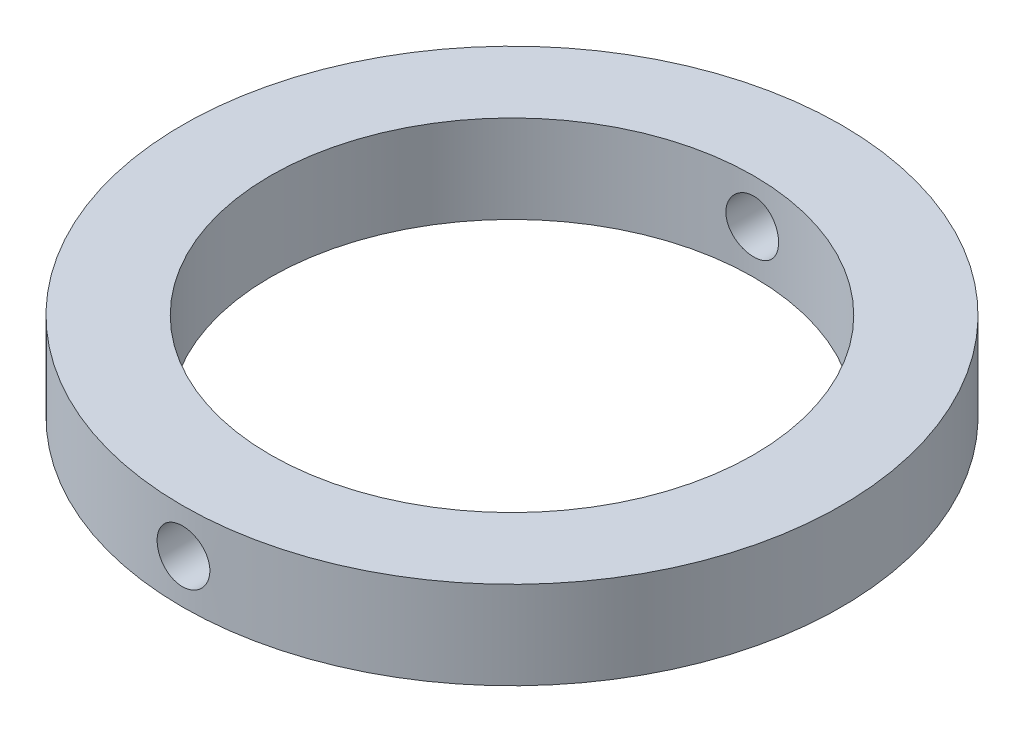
ISO-10303-21;
HEADER;
FILE_DESCRIPTION(('STEP AP214'),'2;1');
FILE_NAME('part.step','',(''),(''),'','','');
FILE_SCHEMA(('AUTOMOTIVE_DESIGN { 1 0 10303 214 1 1 1 1 }'));
ENDSEC;
DATA;
#1=APPLICATION_CONTEXT('core data for automotive mechanical design processes');
#2=APPLICATION_PROTOCOL_DEFINITION('international standard','automotive_design',2000,#1);
#3=PRODUCT_CONTEXT('',#1,'mechanical');
#4=PRODUCT('Part','Part','',(#3));
#5=PRODUCT_RELATED_PRODUCT_CATEGORY('part','',(#4));
#6=PRODUCT_DEFINITION_FORMATION('','',#4);
#7=PRODUCT_DEFINITION_CONTEXT('part definition',#1,'design');
#8=PRODUCT_DEFINITION('design','',#6,#7);
#9=PRODUCT_DEFINITION_SHAPE('','',#8);
#10=(LENGTH_UNIT() NAMED_UNIT(*) SI_UNIT(.MILLI.,.METRE.));
#11=(NAMED_UNIT(*) PLANE_ANGLE_UNIT() SI_UNIT($,.RADIAN.));
#12=(NAMED_UNIT(*) SI_UNIT($,.STERADIAN.) SOLID_ANGLE_UNIT());
#13=UNCERTAINTY_MEASURE_WITH_UNIT(LENGTH_MEASURE(1.E-05),#10,'distance_accuracy_value','');
#14=(GEOMETRIC_REPRESENTATION_CONTEXT(3) GLOBAL_UNCERTAINTY_ASSIGNED_CONTEXT((#13)) GLOBAL_UNIT_ASSIGNED_CONTEXT((#10,
#11,#12)) REPRESENTATION_CONTEXT('',''));
#15=CARTESIAN_POINT('',(0.,0.,0.));
#16=DIRECTION('',(0.,0.,1.));
#17=DIRECTION('',(1.,0.,0.));
#18=AXIS2_PLACEMENT_3D('',#15,#16,#17);
#19=CARTESIAN_POINT('',(0.,10.,0.));
#20=DIRECTION('',(0.,1.,0.));
#21=DIRECTION('',(0.,0.,1.));
#22=AXIS2_PLACEMENT_3D('',#19,#20,#21);
#23=PLANE('',#22);
#24=CARTESIAN_POINT('',(0.,10.,0.));
#25=DIRECTION('',(0.,1.,0.));
#26=DIRECTION('',(0.,0.,1.));
#27=AXIS2_PLACEMENT_3D('',#24,#25,#26);
#28=CIRCLE('',#27,37.5);
#29=CARTESIAN_POINT('',(0.,10.,37.5));
#30=VERTEX_POINT('',#29);
#31=EDGE_CURVE('E10',#30,#30,#28,.T.);
#32=ORIENTED_EDGE('',*,*,#31,.T.);
#33=EDGE_LOOP('',(#32));
#34=FACE_BOUND('',#33,.T.);
#35=CARTESIAN_POINT('',(0.,10.,0.));
#36=DIRECTION('',(0.,1.,0.));
#37=DIRECTION('',(0.,0.,1.));
#38=AXIS2_PLACEMENT_3D('',#35,#36,#37);
#39=CIRCLE('',#38,27.5);
#40=CARTESIAN_POINT('',(0.,10.,27.5));
#41=VERTEX_POINT('',#40);
#42=EDGE_CURVE('E48',#41,#41,#39,.T.);
#43=ORIENTED_EDGE('',*,*,#42,.F.);
#44=EDGE_LOOP('',(#43));
#45=FACE_BOUND('',#44,.T.);
#46=ADVANCED_FACE('F30',(#34,#45),#23,.T.);
#47=CARTESIAN_POINT('',(0.,0.,0.));
#48=DIRECTION('',(0.,1.,0.));
#49=DIRECTION('',(0.,0.,1.));
#50=AXIS2_PLACEMENT_3D('',#47,#48,#49);
#51=PLANE('',#50);
#52=CARTESIAN_POINT('',(0.,0.,0.));
#53=DIRECTION('',(0.,1.,0.));
#54=DIRECTION('',(0.,0.,1.));
#55=AXIS2_PLACEMENT_3D('',#52,#53,#54);
#56=CIRCLE('',#55,37.5);
#57=CARTESIAN_POINT('',(0.,0.,37.5));
#58=VERTEX_POINT('',#57);
#59=EDGE_CURVE('E43',#58,#58,#56,.T.);
#60=ORIENTED_EDGE('',*,*,#59,.F.);
#61=EDGE_LOOP('',(#60));
#62=FACE_BOUND('',#61,.T.);
#63=CARTESIAN_POINT('',(0.,0.,0.));
#64=DIRECTION('',(0.,1.,0.));
#65=DIRECTION('',(0.,0.,1.));
#66=AXIS2_PLACEMENT_3D('',#63,#64,#65);
#67=CIRCLE('',#66,27.5);
#68=CARTESIAN_POINT('',(0.,0.,27.5));
#69=VERTEX_POINT('',#68);
#70=EDGE_CURVE('E51',#69,#69,#67,.T.);
#71=ORIENTED_EDGE('',*,*,#70,.T.);
#72=EDGE_LOOP('',(#71));
#73=FACE_BOUND('',#72,.T.);
#74=ADVANCED_FACE('F84',(#62,#73),#51,.F.);
#75=CARTESIAN_POINT('',(0.,10.,0.));
#76=DIRECTION('',(0.,-1.,0.));
#77=DIRECTION('',(0.,0.,-1.));
#78=AXIS2_PLACEMENT_3D('',#75,#76,#77);
#79=CYLINDRICAL_SURFACE('',#78,37.5);
#80=CARTESIAN_POINT('',(0.,8.,-37.5));
#81=CARTESIAN_POINT('',(-0.168222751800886,7.99999264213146,-37.4999984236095));
#82=CARTESIAN_POINT('',(-0.336560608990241,7.98580296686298,-37.4988559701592));
#83=CARTESIAN_POINT('',(-0.668580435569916,7.92940553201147,-37.4944083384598));
#84=CARTESIAN_POINT('',(-0.832256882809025,7.887165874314,-37.4911006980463));
#85=CARTESIAN_POINT('',(-1.15009704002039,7.77589627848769,-37.4826965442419));
#86=CARTESIAN_POINT('',(-1.3042660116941,7.70688131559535,-37.4776010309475));
#87=CARTESIAN_POINT('',(-1.59879385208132,7.54404654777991,-37.4661928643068));
#88=CARTESIAN_POINT('',(-1.73915570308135,7.45023211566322,-37.459880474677));
#89=CARTESIAN_POINT('',(-2.00245380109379,7.24022185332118,-37.4467304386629));
#90=CARTESIAN_POINT('',(-2.12535298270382,7.12397961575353,-37.4398917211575));
#91=CARTESIAN_POINT('',(-2.34991920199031,6.87251120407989,-37.4264688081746));
#92=CARTESIAN_POINT('',(-2.4515853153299,6.73728420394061,-37.4198846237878));
#93=CARTESIAN_POINT('',(-2.63092348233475,6.45146231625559,-37.4077045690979));
#94=CARTESIAN_POINT('',(-2.70856319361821,6.30084707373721,-37.4021100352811));
#95=CARTESIAN_POINT('',(-2.83743801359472,5.9886661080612,-37.3925546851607));
#96=CARTESIAN_POINT('',(-2.88867355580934,5.82710056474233,-37.3885938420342));
#97=CARTESIAN_POINT('',(-2.96317873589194,5.49797486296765,-37.3827631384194));
#98=CARTESIAN_POINT('',(-2.98650847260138,5.330428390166,-37.3808887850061));
#99=CARTESIAN_POINT('',(-3.00472543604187,4.99378797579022,-37.3794290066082));
#100=CARTESIAN_POINT('',(-2.9996131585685,4.82469406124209,-37.3798435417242));
#101=CARTESIAN_POINT('',(-2.96114091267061,4.49017014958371,-37.3829106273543));
#102=CARTESIAN_POINT('',(-2.92784620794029,4.32473259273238,-37.3855580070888));
#103=CARTESIAN_POINT('',(-2.8340555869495,4.00180163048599,-37.3927843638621));
#104=CARTESIAN_POINT('',(-2.77355942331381,3.84430829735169,-37.3973633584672));
#105=CARTESIAN_POINT('',(-2.62700989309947,3.54152814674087,-37.4079429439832));
#106=CARTESIAN_POINT('',(-2.54092718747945,3.39625558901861,-37.4139451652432));
#107=CARTESIAN_POINT('',(-2.34566931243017,3.12219667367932,-37.4266933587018));
#108=CARTESIAN_POINT('',(-2.23649371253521,2.99341062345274,-37.4334393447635));
#109=CARTESIAN_POINT('',(-1.99778282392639,2.75560096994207,-37.4469379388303));
#110=CARTESIAN_POINT('',(-1.86819110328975,2.64663400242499,-37.4536905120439));
#111=CARTESIAN_POINT('',(-1.59252365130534,2.45199339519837,-37.466423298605));
#112=CARTESIAN_POINT('',(-1.44644791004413,2.36631976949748,-37.4724035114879));
#113=CARTESIAN_POINT('',(-1.1419225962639,2.22070155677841,-37.4829187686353));
#114=CARTESIAN_POINT('',(-0.983471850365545,2.16075941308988,-37.4874536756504));
#115=CARTESIAN_POINT('',(-0.658710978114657,2.06834502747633,-37.4945657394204));
#116=CARTESIAN_POINT('',(-0.492401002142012,2.03587226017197,-37.4971429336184));
#117=CARTESIAN_POINT('',(-0.157133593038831,1.99938926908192,-37.5000443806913));
#118=CARTESIAN_POINT('',(0.0118152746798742,1.99530080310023,-37.5003748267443));
#119=CARTESIAN_POINT('',(0.347996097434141,2.01549759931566,-37.4987620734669));
#120=CARTESIAN_POINT('',(0.515228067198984,2.0397826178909,-37.4968188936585));
#121=CARTESIAN_POINT('',(0.84300537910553,2.11597218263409,-37.4908814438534));
#122=CARTESIAN_POINT('',(1.00355918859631,2.16784052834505,-37.4868898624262));
#123=CARTESIAN_POINT('',(1.31368476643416,2.29768745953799,-37.4773041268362));
#124=CARTESIAN_POINT('',(1.46325637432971,2.37566642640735,-37.4717099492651));
#125=CARTESIAN_POINT('',(1.74752822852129,2.55571814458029,-37.459530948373));
#126=CARTESIAN_POINT('',(1.88219550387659,2.65784280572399,-37.4529440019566));
#127=CARTESIAN_POINT('',(2.13250332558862,2.8832118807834,-37.4395268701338));
#128=CARTESIAN_POINT('',(2.24814356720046,3.00645663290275,-37.4326966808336));
#129=CARTESIAN_POINT('',(2.45738250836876,3.27090660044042,-37.4195445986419));
#130=CARTESIAN_POINT('',(2.55093020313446,3.41215223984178,-37.4132239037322));
#131=CARTESIAN_POINT('',(2.71297900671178,3.70839298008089,-37.4018231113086));
#132=CARTESIAN_POINT('',(2.78148034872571,3.86338795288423,-37.3967430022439));
#133=CARTESIAN_POINT('',(2.89140480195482,4.18254600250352,-37.3884050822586));
#134=CARTESIAN_POINT('',(2.93285929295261,4.34669821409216,-37.385145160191));
#135=CARTESIAN_POINT('',(2.9876155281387,4.67966022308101,-37.3808095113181));
#136=CARTESIAN_POINT('',(3.00091776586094,4.84846993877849,-37.3797337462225));
#137=CARTESIAN_POINT('',(2.99898638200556,5.18544816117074,-37.3798887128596));
#138=CARTESIAN_POINT('',(2.98383290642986,5.35361713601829,-37.3811129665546));
#139=CARTESIAN_POINT('',(2.9255871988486,5.68501370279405,-37.3857162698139));
#140=CARTESIAN_POINT('',(2.88249492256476,5.84824128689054,-37.3890953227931));
#141=CARTESIAN_POINT('',(2.76961478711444,6.16512798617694,-37.3976257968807));
#142=CARTESIAN_POINT('',(2.69982819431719,6.31878755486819,-37.4027771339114));
#143=CARTESIAN_POINT('',(2.53554962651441,6.61222235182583,-37.414271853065));
#144=CARTESIAN_POINT('',(2.44105808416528,6.75199782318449,-37.4206152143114));
#145=CARTESIAN_POINT('',(2.22975108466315,7.01410651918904,-37.4338004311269));
#146=CARTESIAN_POINT('',(2.11287643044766,7.13639195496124,-37.4406435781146));
#147=CARTESIAN_POINT('',(1.86022523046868,7.35965777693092,-37.4540455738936));
#148=CARTESIAN_POINT('',(1.72444410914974,7.46063299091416,-37.4606043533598));
#149=CARTESIAN_POINT('',(1.43759216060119,7.63853623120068,-37.4727095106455));
#150=CARTESIAN_POINT('',(1.28649503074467,7.71542192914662,-37.4782540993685));
#151=CARTESIAN_POINT('',(0.973595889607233,7.84263430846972,-37.4876847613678));
#152=CARTESIAN_POINT('',(0.811806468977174,7.8929916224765,-37.4915727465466));
#153=CARTESIAN_POINT('',(0.540880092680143,7.95284544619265,-37.4962502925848));
#154=CARTESIAN_POINT('',(0.433487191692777,7.9705050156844,-37.4976500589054));
#155=CARTESIAN_POINT('',(0.217412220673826,7.99408465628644,-37.4995254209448));
#156=CARTESIAN_POINT('',(0.10873015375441,8.00000475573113,-37.5000010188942));
#157=CARTESIAN_POINT('',(0.,8.,-37.5));
#158=B_SPLINE_CURVE_WITH_KNOTS('',3,(#80,#81,#82,#83,#84,#85,#86,#87,#88,#89,#90,#91,#92,#93,
#94,#95,#96,#97,#98,#99,#100,#101,#102,#103,#104,#105,#106,#107,#108,#109,#110,#111,#112,#113,
#114,#115,#116,#117,#118,#119,#120,#121,#122,#123,#124,#125,#126,#127,#128,#129,#130,#131,#132,
#133,#134,#135,#136,#137,#138,#139,#140,#141,#142,#143,#144,#145,#146,#147,#148,#149,#150,#151,
#152,#153,#154,#155,#156,#157),.UNSPECIFIED.,.T.,.F.,(4,2,2,2,2,2,2,2,2,2,2,2,2,2,2,2,2,2,2,2,2,
2,2,2,2,2,2,2,2,2,2,2,2,2,2,2,2,2,4),(0.,0.504271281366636,1.00911699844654,1.51368076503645,
2.01813530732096,2.52364507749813,3.02917684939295,3.53538619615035,4.04158723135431,
4.54669612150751,5.05179620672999,5.5557297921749,6.05966796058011,6.56418621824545,
7.06871388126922,7.57466139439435,8.0806092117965,8.58660506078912,9.09259123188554,
9.59718208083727,10.1017685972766,10.605694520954,11.1096278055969,11.614654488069,
12.1196892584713,12.6258788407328,13.1320637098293,13.6376602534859,14.143247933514,
14.6474137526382,15.1515803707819,15.6557230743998,16.1598569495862,16.6653430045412,
17.170951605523,17.6774437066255,18.1833496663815,18.5092843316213,18.8352182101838),.UNSPECIFIED.);
#159=CARTESIAN_POINT('',(0.,8.,-37.5));
#160=VERTEX_POINT('',#159);
#161=EDGE_CURVE('E74',#160,#160,#158,.T.);
#162=ORIENTED_EDGE('',*,*,#161,.T.);
#163=EDGE_LOOP('',(#162));
#164=FACE_BOUND('',#163,.T.);
#165=CARTESIAN_POINT('',(3.,5.,37.3798073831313));
#166=CARTESIAN_POINT('',(2.99999264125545,4.83177821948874,37.3798089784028));
#167=CARTESIAN_POINT('',(2.98580312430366,4.66344133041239,37.3809551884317));
#168=CARTESIAN_POINT('',(2.92940637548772,4.33142351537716,37.3854162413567));
#169=CARTESIAN_POINT('',(2.88716724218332,4.16774811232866,37.3887335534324));
#170=CARTESIAN_POINT('',(2.77589918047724,3.84991016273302,37.3971586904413));
#171=CARTESIAN_POINT('',(2.70688525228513,3.69574234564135,37.4022655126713));
#172=CARTESIAN_POINT('',(2.54405292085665,3.40121643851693,37.4136930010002));
#173=CARTESIAN_POINT('',(2.4502398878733,3.26085536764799,37.4200134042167));
#174=CARTESIAN_POINT('',(2.24023103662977,2.99755638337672,37.4331727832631));
#175=CARTESIAN_POINT('',(2.12398849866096,2.87465578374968,37.4400128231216));
#176=CARTESIAN_POINT('',(1.87251889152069,2.65008682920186,37.4534310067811));
#177=CARTESIAN_POINT('',(1.73729100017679,2.54841939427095,37.4600091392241));
#178=CARTESIAN_POINT('',(1.45146833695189,2.36907984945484,37.4721722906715));
#179=CARTESIAN_POINT('',(1.30085336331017,2.29143983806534,37.477755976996));
#180=CARTESIAN_POINT('',(0.988672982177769,2.16256438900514,37.4872896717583));
#181=CARTESIAN_POINT('',(0.827107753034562,2.11132852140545,37.4912397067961));
#182=CARTESIAN_POINT('',(0.497982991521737,2.03682265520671,37.4970536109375));
#183=CARTESIAN_POINT('',(0.330437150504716,2.01349253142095,37.4989219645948));
#184=CARTESIAN_POINT('',(-0.00620202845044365,1.99527457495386,37.5003771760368));
#185=CARTESIAN_POINT('',(-0.175295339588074,2.00038625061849,37.4999640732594));
#186=CARTESIAN_POINT('',(-0.509821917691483,2.03885754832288,37.4969066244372));
#187=CARTESIAN_POINT('',(-0.675262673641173,2.07215251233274,37.4942673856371));
#188=CARTESIAN_POINT('',(-0.998199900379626,2.16594476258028,37.4870604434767));
#189=CARTESIAN_POINT('',(-1.15569630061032,2.22644229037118,37.4824927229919));
#190=CARTESIAN_POINT('',(-1.45848015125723,2.37299463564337,37.4719339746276));
#191=CARTESIAN_POINT('',(-1.6037534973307,2.45907847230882,37.4659413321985));
#192=CARTESIAN_POINT('',(-1.87781350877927,2.65433875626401,37.4532063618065));
#193=CARTESIAN_POINT('',(-2.00659986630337,2.76351563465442,37.4464640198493));
#194=CARTESIAN_POINT('',(-2.2444080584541,3.00222742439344,37.43296527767));
#195=CARTESIAN_POINT('',(-2.35337351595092,3.13181850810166,37.4262088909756));
#196=CARTESIAN_POINT('',(-2.54801138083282,3.40748414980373,37.4134625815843));
#197=CARTESIAN_POINT('',(-2.63368377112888,3.55355871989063,37.4074726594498));
#198=CARTESIAN_POINT('',(-2.77930109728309,3.85808372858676,37.3969362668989));
#199=CARTESIAN_POINT('',(-2.83924320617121,4.01653552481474,37.3923899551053));
#200=CARTESIAN_POINT('',(-2.93165719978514,4.34129867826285,37.3852585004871));
#201=CARTESIAN_POINT('',(-2.96412961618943,4.50760988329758,37.3826733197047));
#202=CARTESIAN_POINT('',(-3.00061128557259,4.84287784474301,37.379762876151));
#203=CARTESIAN_POINT('',(-3.00469911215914,5.01182599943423,37.3794313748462));
#204=CARTESIAN_POINT('',(-2.98450129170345,5.34800524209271,37.381049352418));
#205=CARTESIAN_POINT('',(-2.96021588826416,5.51523634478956,37.3829988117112));
#206=CARTESIAN_POINT('',(-2.88402644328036,5.84300944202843,37.3889533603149));
#207=CARTESIAN_POINT('',(-2.83215898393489,6.00355999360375,37.3929557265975));
#208=CARTESIAN_POINT('',(-2.70231491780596,6.31367944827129,37.4025628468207));
#209=CARTESIAN_POINT('',(-2.62433792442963,6.46324818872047,37.4081676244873));
#210=CARTESIAN_POINT('',(-2.4442890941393,6.74751811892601,37.4203631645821));
#211=CARTESIAN_POINT('',(-2.34216484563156,6.88218601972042,37.4269560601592));
#212=CARTESIAN_POINT('',(-2.1167962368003,7.1324952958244,37.4403777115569));
#213=CARTESIAN_POINT('',(-1.99355154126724,7.24813636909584,37.4472064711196));
#214=CARTESIAN_POINT('',(-1.72910120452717,7.45737706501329,37.4603489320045));
#215=CARTESIAN_POINT('',(-1.58785513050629,7.55092567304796,37.4666614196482));
#216=CARTESIAN_POINT('',(-1.29161328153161,7.71297607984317,37.4780426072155));
#217=CARTESIAN_POINT('',(-1.13661763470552,7.78147811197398,37.4831113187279));
#218=CARTESIAN_POINT('',(-0.817460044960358,7.89140303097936,37.4914282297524));
#219=CARTESIAN_POINT('',(-0.653309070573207,7.93285759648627,37.494678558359));
#220=CARTESIAN_POINT('',(-0.320349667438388,7.98761440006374,37.4990010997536));
#221=CARTESIAN_POINT('',(-0.151541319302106,8.00091712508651,37.5000733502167));
#222=CARTESIAN_POINT('',(0.185437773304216,7.99898714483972,37.4999189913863));
#223=CARTESIAN_POINT('',(0.353608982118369,7.98383400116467,37.4986987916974));
#224=CARTESIAN_POINT('',(0.685010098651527,7.92558817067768,37.4941093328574));
#225=CARTESIAN_POINT('',(0.848239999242,7.88249544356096,37.4907400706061));
#226=CARTESIAN_POINT('',(1.16513127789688,7.7696135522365,37.4822306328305));
#227=CARTESIAN_POINT('',(1.3187931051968,7.69982564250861,37.4770905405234));
#228=CARTESIAN_POINT('',(1.61223186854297,7.53554374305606,37.4656148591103));
#229=CARTESIAN_POINT('',(1.7520090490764,7.44105018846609,37.4592792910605));
#230=CARTESIAN_POINT('',(2.01411759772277,7.22974099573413,37.4461029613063));
#231=CARTESIAN_POINT('',(2.13640154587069,7.11286661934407,37.4392608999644));
#232=CARTESIAN_POINT('',(2.35966449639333,6.86021658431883,37.4258537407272));
#233=CARTESIAN_POINT('',(2.46063832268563,6.72443634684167,37.41928871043));
#234=CARTESIAN_POINT('',(2.63854009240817,6.43758509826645,37.4071663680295));
#235=CARTESIAN_POINT('',(2.71542545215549,6.28648762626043,37.4016108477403));
#236=CARTESIAN_POINT('',(2.84263710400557,5.97358775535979,37.3921585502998));
#237=CARTESIAN_POINT('',(2.89299403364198,5.81179794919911,37.3882598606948));
#238=CARTESIAN_POINT('',(2.95284675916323,5.54087260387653,37.3835687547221));
#239=CARTESIAN_POINT('',(2.97050583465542,5.43348119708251,37.3821646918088));
#240=CARTESIAN_POINT('',(2.99408481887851,5.21740922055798,37.3802834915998));
#241=CARTESIAN_POINT('',(3.00000475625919,5.10872865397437,37.3798063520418));
#242=CARTESIAN_POINT('',(3.,5.,37.3798073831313));
#243=B_SPLINE_CURVE_WITH_KNOTS('',3,(#165,#166,#167,#168,#169,#170,#171,#172,#173,#174,#175,
#176,#177,#178,#179,#180,#181,#182,#183,#184,#185,#186,#187,#188,#189,#190,#191,#192,#193,#194,
#195,#196,#197,#198,#199,#200,#201,#202,#203,#204,#205,#206,#207,#208,#209,#210,#211,#212,#213,
#214,#215,#216,#217,#218,#219,#220,#221,#222,#223,#224,#225,#226,#227,#228,#229,#230,#231,#232,
#233,#234,#235,#236,#237,#238,#239,#240,#241,#242),.UNSPECIFIED.,.T.,.F.,(4,2,2,2,2,2,2,2,2,2,2,
2,2,2,2,2,2,2,2,2,2,2,2,2,2,2,2,2,2,2,2,2,2,2,2,2,2,2,4),(0.,0.50426836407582,1.0091112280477,
1.51367166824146,2.01812293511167,2.52363652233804,3.02917200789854,3.53537995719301,
4.04157966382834,4.54668674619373,5.05178509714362,5.55572778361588,6.05967494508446,
6.56419586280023,7.0687261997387,7.57466988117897,8.080613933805,8.58661355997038,
9.09260339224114,9.59719199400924,10.101776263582,10.6056929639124,11.1096171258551,
11.6146452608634,12.1196814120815,12.6258726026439,13.1320590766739,13.6376516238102,
14.1432354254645,14.647407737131,15.1515807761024,15.6557301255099,16.1598705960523,
16.6653527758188,17.1709575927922,17.6774512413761,18.1833586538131,18.5092888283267,
18.8352182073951),.UNSPECIFIED.);
#244=CARTESIAN_POINT('',(3.,5.,37.3798073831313));
#245=VERTEX_POINT('',#244);
#246=EDGE_CURVE('E70',#245,#245,#243,.T.);
#247=ORIENTED_EDGE('',*,*,#246,.T.);
#248=EDGE_LOOP('',(#247));
#249=FACE_BOUND('',#248,.T.);
#250=ORIENTED_EDGE('',*,*,#31,.F.);
#251=EDGE_LOOP('',(#250));
#252=FACE_BOUND('',#251,.T.);
#253=ORIENTED_EDGE('',*,*,#59,.T.);
#254=EDGE_LOOP('',(#253));
#255=FACE_BOUND('',#254,.T.);
#256=ADVANCED_FACE('F32',(#164,#249,#252,#255),#79,.T.);
#257=CARTESIAN_POINT('',(0.,10.,0.));
#258=DIRECTION('',(0.,-1.,0.));
#259=DIRECTION('',(0.,0.,-1.));
#260=AXIS2_PLACEMENT_3D('',#257,#258,#259);
#261=CYLINDRICAL_SURFACE('',#260,27.5);
#262=CARTESIAN_POINT('',(0.,8.,-27.5));
#263=CARTESIAN_POINT('',(-0.167975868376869,7.9999927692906,-27.4999979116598));
#264=CARTESIAN_POINT('',(-0.336060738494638,7.98584453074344,-27.4984446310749));
#265=CARTESIAN_POINT('',(-0.667564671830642,7.92962131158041,-27.492397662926));
#266=CARTESIAN_POINT('',(-0.830978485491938,7.88751610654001,-27.4879007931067));
#267=CARTESIAN_POINT('',(-1.14829223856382,7.77662437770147,-27.4764739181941));
#268=CARTESIAN_POINT('',(-1.30219807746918,7.70785459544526,-27.4695454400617));
#269=CARTESIAN_POINT('',(-1.59625097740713,7.54561978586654,-27.4540286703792));
#270=CARTESIAN_POINT('',(-1.73640063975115,7.45215943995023,-27.445440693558));
#271=CARTESIAN_POINT('',(-1.99958990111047,7.24277134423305,-27.4275251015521));
#272=CARTESIAN_POINT('',(-2.12256280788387,7.12675998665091,-27.4181948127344));
#273=CARTESIAN_POINT('',(-2.34733416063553,6.87574186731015,-27.3998680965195));
#274=CARTESIAN_POINT('',(-2.44913159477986,6.74073419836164,-27.3908716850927));
#275=CARTESIAN_POINT('',(-2.6289031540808,6.45513239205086,-27.374204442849));
#276=CARTESIAN_POINT('',(-2.70681613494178,6.30449955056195,-27.3665370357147));
#277=CARTESIAN_POINT('',(-2.8362166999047,5.99219089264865,-27.353429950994));
#278=CARTESIAN_POINT('',(-2.88770505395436,5.83051539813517,-27.3479902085));
#279=CARTESIAN_POINT('',(-2.96259521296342,5.50139572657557,-27.3399790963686));
#280=CARTESIAN_POINT('',(-2.98610841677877,5.3339771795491,-27.3373963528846));
#281=CARTESIAN_POINT('',(-3.00472529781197,4.99755170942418,-27.3353565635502));
#282=CARTESIAN_POINT('',(-2.99982985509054,4.82854483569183,-27.3358994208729));
#283=CARTESIAN_POINT('',(-2.9618600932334,4.4945109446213,-27.3400390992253));
#284=CARTESIAN_POINT('',(-2.92890776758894,4.32946987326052,-27.3436226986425));
#285=CARTESIAN_POINT('',(-2.83594963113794,4.00727453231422,-27.353419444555));
#286=CARTESIAN_POINT('',(-2.77594339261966,3.85012038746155,-27.3596326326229));
#287=CARTESIAN_POINT('',(-2.63044732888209,3.54777671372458,-27.374003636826));
#288=CARTESIAN_POINT('',(-2.54490375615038,3.40261325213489,-27.3821655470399));
#289=CARTESIAN_POINT('',(-2.35079985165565,3.1286569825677,-27.3995110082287));
#290=CARTESIAN_POINT('',(-2.2422387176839,2.99986474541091,-27.4086945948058));
#291=CARTESIAN_POINT('',(-2.00450176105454,2.76159823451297,-27.4271075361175));
#292=CARTESIAN_POINT('',(-1.87522065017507,2.65222898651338,-27.4363368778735));
#293=CARTESIAN_POINT('',(-1.6000781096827,2.45672833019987,-27.4537560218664));
#294=CARTESIAN_POINT('',(-1.45421665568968,2.37059695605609,-27.4619458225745));
#295=CARTESIAN_POINT('',(-1.14997834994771,2.22401976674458,-27.4763665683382));
#296=CARTESIAN_POINT('',(-0.991598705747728,2.16357970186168,-27.4825970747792));
#297=CARTESIAN_POINT('',(-0.666856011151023,2.07017993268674,-27.4923929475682));
#298=CARTESIAN_POINT('',(-0.500493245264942,2.03721924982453,-27.495958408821));
#299=CARTESIAN_POINT('',(-0.165415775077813,1.99984808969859,-27.5000102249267));
#300=CARTESIAN_POINT('',(0.00328259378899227,1.99529276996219,-27.5005122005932));
#301=CARTESIAN_POINT('',(0.339040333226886,2.0144806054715,-27.4984224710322));
#302=CARTESIAN_POINT('',(0.506099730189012,2.03822330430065,-27.4958308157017));
#303=CARTESIAN_POINT('',(0.833416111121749,2.11321298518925,-27.4878549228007));
#304=CARTESIAN_POINT('',(0.993688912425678,2.16439172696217,-27.4824776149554));
#305=CARTESIAN_POINT('',(1.30337528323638,2.29273031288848,-27.4695332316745));
#306=CARTESIAN_POINT('',(1.45278856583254,2.36989084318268,-27.4619660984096));
#307=CARTESIAN_POINT('',(1.73716679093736,2.54835894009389,-27.4454485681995));
#308=CARTESIAN_POINT('',(1.87207200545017,2.64976117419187,-27.4364927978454));
#309=CARTESIAN_POINT('',(2.12299899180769,2.87369912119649,-27.4182190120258));
#310=CARTESIAN_POINT('',(2.23902019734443,2.99623546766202,-27.4089009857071));
#311=CARTESIAN_POINT('',(2.44939239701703,3.25959735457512,-27.3909054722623));
#312=CARTESIAN_POINT('',(2.54364800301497,3.40049931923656,-27.3822309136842));
#313=CARTESIAN_POINT('',(2.70715660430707,3.69621788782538,-27.3665503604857));
#314=CARTESIAN_POINT('',(2.77640999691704,3.85103427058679,-27.3595443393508));
#315=CARTESIAN_POINT('',(2.88779039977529,4.16986644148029,-27.348013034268));
#316=CARTESIAN_POINT('',(2.92997315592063,4.33386256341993,-27.3434826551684));
#317=CARTESIAN_POINT('',(2.98619531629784,4.66666227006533,-27.3374002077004));
#318=CARTESIAN_POINT('',(3.00023569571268,4.83546568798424,-27.3358480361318));
#319=CARTESIAN_POINT('',(2.99975954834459,5.17213993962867,-27.3359002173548));
#320=CARTESIAN_POINT('',(2.98539286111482,5.34001100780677,-27.3374880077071));
#321=CARTESIAN_POINT('',(2.92882562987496,5.67093886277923,-27.3436057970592));
#322=CARTESIAN_POINT('',(2.88662506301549,5.83399564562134,-27.3481357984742));
#323=CARTESIAN_POINT('',(2.77563125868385,6.15065882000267,-27.3596228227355));
#324=CARTESIAN_POINT('',(2.7068433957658,6.30426711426,-27.366579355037));
#325=CARTESIAN_POINT('',(2.54464271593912,6.59778278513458,-27.3821365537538));
#326=CARTESIAN_POINT('',(2.45122988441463,6.73769015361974,-27.3907372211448));
#327=CARTESIAN_POINT('',(2.24187003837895,7.00060007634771,-27.4086680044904));
#328=CARTESIAN_POINT('',(2.12581126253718,7.12351339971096,-27.4180015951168));
#329=CARTESIAN_POINT('',(1.87468089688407,7.34818230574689,-27.4363151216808));
#330=CARTESIAN_POINT('',(1.73960478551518,7.44993284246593,-27.4452949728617));
#331=CARTESIAN_POINT('',(1.45383048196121,7.62963126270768,-27.4619174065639));
#332=CARTESIAN_POINT('',(1.30308750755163,7.707508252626,-27.4695559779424));
#333=CARTESIAN_POINT('',(0.990672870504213,7.83673772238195,-27.4825928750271));
#334=CARTESIAN_POINT('',(0.829013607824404,7.88811974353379,-27.4879936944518));
#335=CARTESIAN_POINT('',(0.555387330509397,7.95026081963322,-27.494608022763));
#336=CARTESIAN_POINT('',(0.445162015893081,7.96888708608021,-27.4966204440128));
#337=CARTESIAN_POINT('',(0.223307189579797,7.99375904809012,-27.4993171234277));
#338=CARTESIAN_POINT('',(0.111677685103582,8.00000480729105,-27.5000013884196));
#339=CARTESIAN_POINT('',(0.,8.,-27.5));
#340=B_SPLINE_CURVE_WITH_KNOTS('',3,(#262,#263,#264,#265,#266,#267,#268,#269,#270,#271,#272,
#273,#274,#275,#276,#277,#278,#279,#280,#281,#282,#283,#284,#285,#286,#287,#288,#289,#290,#291,
#292,#293,#294,#295,#296,#297,#298,#299,#300,#301,#302,#303,#304,#305,#306,#307,#308,#309,#310,
#311,#312,#313,#314,#315,#316,#317,#318,#319,#320,#321,#322,#323,#324,#325,#326,#327,#328,#329,
#330,#331,#332,#333,#334,#335,#336,#337,#338,#339),.UNSPECIFIED.,.T.,.F.,(4,2,2,2,2,2,2,2,2,2,2,
2,2,2,2,2,2,2,2,2,2,2,2,2,2,2,2,2,2,2,2,2,2,2,2,2,2,2,4),(0.,0.503519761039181,1.00758476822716,
1.51133380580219,2.01498739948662,2.52054518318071,3.02612711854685,3.53299274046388,
4.03984359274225,4.54466930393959,5.04947937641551,5.55210563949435,6.05473984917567,
6.55843948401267,7.06215667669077,7.56851976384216,8.07488359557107,8.5813607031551,
9.08781977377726,9.5916942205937,10.0955605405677,10.5981793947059,11.1008115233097,
11.6054395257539,12.1100826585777,12.6168971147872,13.1237035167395,13.6294628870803,
14.1352047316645,14.6382860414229,15.1413677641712,15.6443478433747,16.1473282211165,
16.6528567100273,17.1585055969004,17.6656418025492,18.1722113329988,18.5069749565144,
18.8417368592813),.UNSPECIFIED.);
#341=CARTESIAN_POINT('',(0.,8.,-27.5));
#342=VERTEX_POINT('',#341);
#343=EDGE_CURVE('E35',#342,#342,#340,.T.);
#344=ORIENTED_EDGE('',*,*,#343,.F.);
#345=EDGE_LOOP('',(#344));
#346=FACE_BOUND('',#345,.T.);
#347=CARTESIAN_POINT('',(3.,5.,27.3358738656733));
#348=CARTESIAN_POINT('',(2.99999276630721,4.83202748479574,27.3358760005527));
#349=CARTESIAN_POINT('',(2.98584507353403,4.66394595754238,27.3374387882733));
#350=CARTESIAN_POINT('',(2.92962421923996,4.33244896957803,27.3435197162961));
#351=CARTESIAN_POINT('',(2.88752082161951,4.16903876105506,27.3480410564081));
#352=CARTESIAN_POINT('',(2.77663437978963,3.85173263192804,27.3595209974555));
#353=CARTESIAN_POINT('',(2.70786816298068,3.69783078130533,27.3664780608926));
#354=CARTESIAN_POINT('',(2.5456417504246,3.40378456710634,27.3820436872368));
#355=CARTESIAN_POINT('',(2.45218622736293,3.26363760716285,27.3906519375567));
#356=CARTESIAN_POINT('',(2.24280300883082,3.00044530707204,27.4085914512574));
#357=CARTESIAN_POINT('',(2.12679062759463,2.87746751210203,27.4179253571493));
#358=CARTESIAN_POINT('',(1.87576840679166,2.6526867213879,27.436240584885));
#359=CARTESIAN_POINT('',(1.74075767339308,2.55088472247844,27.4452218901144));
#360=CARTESIAN_POINT('',(1.45515316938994,2.37110837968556,27.4618464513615));
#361=CARTESIAN_POINT('',(1.30452122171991,2.29319434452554,27.4694863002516));
#362=CARTESIAN_POINT('',(0.992214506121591,2.16379158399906,27.4825382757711));
#363=CARTESIAN_POINT('',(0.83054005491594,2.11230210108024,27.4879504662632));
#364=CARTESIAN_POINT('',(0.501423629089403,2.03740959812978,27.4959187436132));
#365=CARTESIAN_POINT('',(0.33400730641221,2.01389507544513,27.4984861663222));
#366=CARTESIAN_POINT('',(-0.00241380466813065,1.99527478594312,27.5005142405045));
#367=CARTESIAN_POINT('',(-0.171418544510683,2.00016815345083,27.4999749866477));
#368=CARTESIAN_POINT('',(-0.505461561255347,2.03813461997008,27.4958597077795));
#369=CARTESIAN_POINT('',(-0.670513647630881,2.07108781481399,27.4922966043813));
#370=CARTESIAN_POINT('',(-0.992730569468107,2.16405150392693,27.4825487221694));
#371=CARTESIAN_POINT('',(-1.14989528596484,2.2240624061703,27.4763639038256));
#372=CARTESIAN_POINT('',(-1.45225181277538,2.36956814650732,27.4620455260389));
#373=CARTESIAN_POINT('',(-1.59741808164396,2.45511564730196,27.4539079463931));
#374=CARTESIAN_POINT('',(-1.87137830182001,2.64922794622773,27.4365962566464));
#375=CARTESIAN_POINT('',(-2.00017168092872,2.75779354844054,27.4274221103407));
#376=CARTESIAN_POINT('',(-2.23843318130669,2.9955336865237,27.4090094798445));
#377=CARTESIAN_POINT('',(-2.34779717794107,3.12481259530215,27.399770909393));
#378=CARTESIAN_POINT('',(-2.54328828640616,3.3999488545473,27.3823181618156));
#379=CARTESIAN_POINT('',(-2.62941535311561,3.54580623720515,27.3741039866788));
#380=CARTESIAN_POINT('',(-2.77598943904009,3.85004341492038,27.3596296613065));
#381=CARTESIAN_POINT('',(-2.83642938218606,4.00842664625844,27.3533700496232));
#382=CARTESIAN_POINT('',(-2.92982780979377,4.3331771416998,27.3435245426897));
#383=CARTESIAN_POINT('',(-2.96278729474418,4.49954411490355,27.3399385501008));
#384=CARTESIAN_POINT('',(-3.00015393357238,4.83462358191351,27.335863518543));
#385=CARTESIAN_POINT('',(-3.00470704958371,5.00331961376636,27.3353586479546));
#386=CARTESIAN_POINT('',(-2.98551564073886,5.33907215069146,27.3374612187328));
#387=CARTESIAN_POINT('',(-2.96177157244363,5.50612868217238,27.3400686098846));
#388=CARTESIAN_POINT('',(-2.88678218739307,5.83343060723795,27.348087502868));
#389=CARTESIAN_POINT('',(-2.83560644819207,5.99369213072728,27.3534919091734));
#390=CARTESIAN_POINT('',(-2.70727764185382,6.3033572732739,27.3664901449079));
#391=CARTESIAN_POINT('',(-2.63012387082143,6.45276059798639,27.3740840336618));
#392=CARTESIAN_POINT('',(-2.45166575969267,6.73713197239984,27.3906437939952));
#393=CARTESIAN_POINT('',(-2.35026503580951,6.8720392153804,27.3996150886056));
#394=CARTESIAN_POINT('',(-2.12632891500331,7.12297099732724,27.4179013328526));
#395=CARTESIAN_POINT('',(-2.00379289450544,7.23899497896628,27.4272162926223));
#396=CARTESIAN_POINT('',(-1.74042980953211,7.44937327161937,27.4451883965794));
#397=CARTESIAN_POINT('',(-1.59952626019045,7.54363212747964,27.4538425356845));
#398=CARTESIAN_POINT('',(-1.30380364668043,7.70714642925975,27.4694737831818));
#399=CARTESIAN_POINT('',(-1.14898480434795,7.77640227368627,27.4764509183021));
#400=CARTESIAN_POINT('',(-0.830154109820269,7.88778427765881,27.4879285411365));
#401=CARTESIAN_POINT('',(-0.666162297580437,7.92996724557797,27.4924342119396));
#402=CARTESIAN_POINT('',(-0.333371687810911,7.98619128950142,27.4984825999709));
#403=CARTESIAN_POINT('',(-0.164573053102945,8.00023331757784,27.500025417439));
#404=CARTESIAN_POINT('',(0.17210395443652,7.9997620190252,27.4999740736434));
#405=CARTESIAN_POINT('',(0.339982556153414,7.98539653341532,27.4983961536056));
#406=CARTESIAN_POINT('',(0.670925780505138,7.92882905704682,27.4923127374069));
#407=CARTESIAN_POINT('',(0.833990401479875,7.88662705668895,27.4878072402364));
#408=CARTESIAN_POINT('',(1.15066942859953,7.77562738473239,27.4763731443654));
#409=CARTESIAN_POINT('',(1.30428570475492,7.70683499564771,27.4694450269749));
#410=CARTESIAN_POINT('',(1.59781545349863,7.5446227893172,27.4539362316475));
#411=CARTESIAN_POINT('',(1.73772892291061,7.4512029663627,27.4453555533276));
#412=CARTESIAN_POINT('',(2.00063860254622,7.2418353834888,27.4274483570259));
#413=CARTESIAN_POINT('',(2.1235468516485,7.12577746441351,27.4181183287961));
#414=CARTESIAN_POINT('',(2.34820591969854,6.87465090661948,27.3997932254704));
#415=CARTESIAN_POINT('',(2.44995167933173,6.73957773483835,27.390798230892));
#416=CARTESIAN_POINT('',(2.62964490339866,6.45380587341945,27.3741330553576));
#417=CARTESIAN_POINT('',(2.70752063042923,6.3030618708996,27.3664668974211));
#418=CARTESIAN_POINT('',(2.836747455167,5.99064506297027,27.353374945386));
#419=CARTESIAN_POINT('',(2.88812811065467,5.82898466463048,27.3479466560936));
#420=CARTESIAN_POINT('',(2.9502653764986,5.55536203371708,27.3412969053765));
#421=CARTESIAN_POINT('',(2.96888992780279,5.44514177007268,27.3392730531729));
#422=CARTESIAN_POINT('',(2.99375961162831,5.22329706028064,27.3365608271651));
#423=CARTESIAN_POINT('',(3.00000480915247,5.11167262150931,27.3358724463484));
#424=CARTESIAN_POINT('',(3.,5.,27.3358738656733));
#425=B_SPLINE_CURVE_WITH_KNOTS('',3,(#347,#348,#349,#350,#351,#352,#353,#354,#355,#356,#357,
#358,#359,#360,#361,#362,#363,#364,#365,#366,#367,#368,#369,#370,#371,#372,#373,#374,#375,#376,
#377,#378,#379,#380,#381,#382,#383,#384,#385,#386,#387,#388,#389,#390,#391,#392,#393,#394,#395,
#396,#397,#398,#399,#400,#401,#402,#403,#404,#405,#406,#407,#408,#409,#410,#411,#412,#413,#414,
#415,#416,#417,#418,#419,#420,#421,#422,#423,#424),.UNSPECIFIED.,.T.,.F.,(4,2,2,2,2,2,2,2,2,2,2,
2,2,2,2,2,2,2,2,2,2,2,2,2,2,2,2,2,2,2,2,2,2,2,2,2,2,2,4),(0.,0.503509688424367,1.00756484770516,
1.51130240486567,2.01494469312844,2.52051565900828,3.0261104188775,3.53297131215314,
4.03981767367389,4.54463700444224,5.04944095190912,5.55209855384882,6.05476373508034,
6.55847278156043,7.06219942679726,7.56854912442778,8.07489980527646,8.58138988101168,
9.08786151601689,9.59172855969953,10.0955874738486,10.5981744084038,11.100774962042,
11.605407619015,12.1100551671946,12.6168756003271,13.1236879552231,13.6294333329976,
14.1351615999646,14.6382648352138,15.1413682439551,15.6443717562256,16.1473753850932,
16.6528906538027,17.1585266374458,17.6656676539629,18.1722416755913,18.5069901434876,
18.8417368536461),.UNSPECIFIED.);
#426=CARTESIAN_POINT('',(3.,5.,27.3358738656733));
#427=VERTEX_POINT('',#426);
#428=EDGE_CURVE('E53',#427,#427,#425,.T.);
#429=ORIENTED_EDGE('',*,*,#428,.F.);
#430=EDGE_LOOP('',(#429));
#431=FACE_BOUND('',#430,.T.);
#432=ORIENTED_EDGE('',*,*,#42,.T.);
#433=EDGE_LOOP('',(#432));
#434=FACE_BOUND('',#433,.T.);
#435=ORIENTED_EDGE('',*,*,#70,.F.);
#436=EDGE_LOOP('',(#435));
#437=FACE_BOUND('',#436,.T.);
#438=ADVANCED_FACE('F57',(#346,#431,#434,#437),#261,.F.);
#439=CARTESIAN_POINT('',(0.,5.,-52.5));
#440=DIRECTION('',(0.,0.,1.));
#441=DIRECTION('',(1.,0.,0.));
#442=AXIS2_PLACEMENT_3D('',#439,#440,#441);
#443=CYLINDRICAL_SURFACE('',#442,3.);
#444=ORIENTED_EDGE('',*,*,#428,.T.);
#445=EDGE_LOOP('',(#444));
#446=FACE_BOUND('',#445,.T.);
#447=ORIENTED_EDGE('',*,*,#246,.F.);
#448=EDGE_LOOP('',(#447));
#449=FACE_BOUND('',#448,.T.);
#450=ADVANCED_FACE('F63',(#446,#449),#443,.F.);
#451=ORIENTED_EDGE('',*,*,#343,.T.);
#452=EDGE_LOOP('',(#451));
#453=FACE_BOUND('',#452,.T.);
#454=ORIENTED_EDGE('',*,*,#161,.F.);
#455=EDGE_LOOP('',(#454));
#456=FACE_BOUND('',#455,.T.);
#457=ADVANCED_FACE('F60',(#453,#456),#443,.F.);
#458=CLOSED_SHELL('',(#46,#74,#256,#438,#450,#457));
#459=MANIFOLD_SOLID_BREP('B2',#458);
#460=ADVANCED_BREP_SHAPE_REPRESENTATION('',(#18,#459),#14);
#461=SHAPE_DEFINITION_REPRESENTATION(#9,#460);
ENDSEC;
END-ISO-10303-21;
